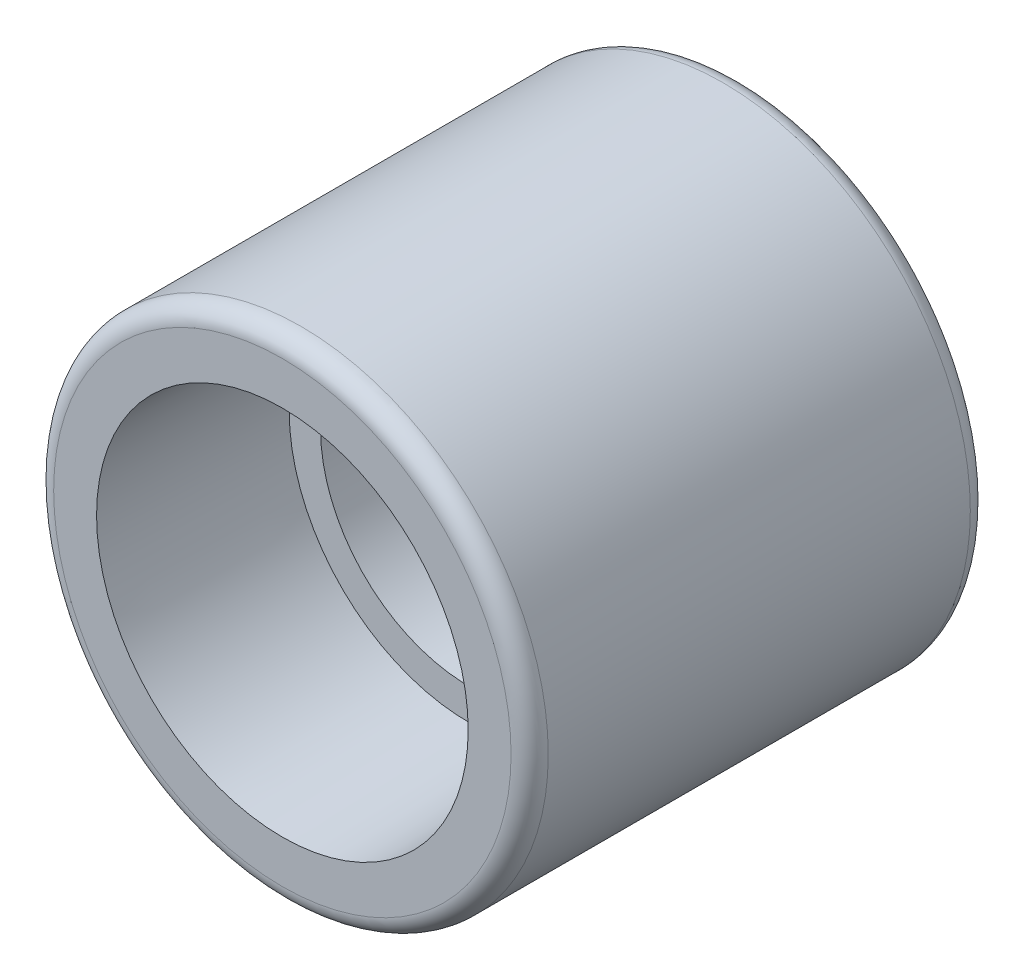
from build123d import *

# Parameters (mm, degrees)
BODYSCH_R  = 22.225
BODY_DEPTH = 41.275
FLOWSCH_R  = 13.3604
FLOW_DEPTH = 31.75
FILLET1_R  = 1.67005


with BuildPart() as part:
    # BodySch → Body (new body)
    with BuildSketch(Plane.XY):
        Circle(BODYSCH_R)
    extrude(amount=BODY_DEPTH)

    # FlowSch → Flow (cut)
    with BuildSketch(Plane.XY.offset(41.275)):
        Circle(FLOWSCH_R)
    extrude(amount=-FLOW_DEPTH, mode=Mode.SUBTRACT)

    # ThreadSch → Thread (revolve, cut)
    with BuildSketch(Plane(origin=(0, 0, 0), x_dir=(0, 0, -1), z_dir=(1, 0, 0)), mode=Mode.PRIVATE) as thread_sk:
        Polygon((-24.4856, 0), (-24.4856, 16.177760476), (-41.275, 16.7005), (-41.275, 0), align=None)
    revolve(thread_sk.sketch.rotate(Axis((0, 0, 0), (0, 0, 1)), 90), axis=Axis((0, 0, 0), (0, 0, 1)), mode=Mode.SUBTRACT)

    # Fillet1
    fillet1_edges = [part.edges().sort_by_distance(p)[0] for p in [
        (-22.225, 0, 0),
        (-22.225, 0, 41.275),
    ]]
    fillet(fillet1_edges, radius=FILLET1_R)


solid = part.part
